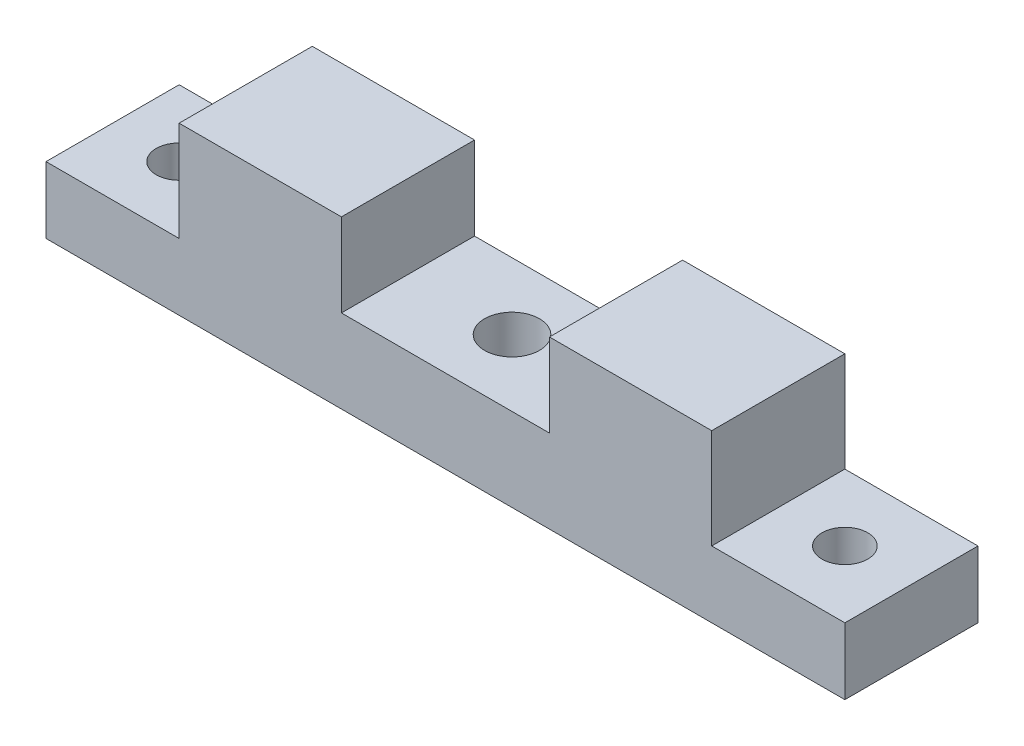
ISO-10303-21;
HEADER;
FILE_DESCRIPTION(('STEP AP214'),'2;1');
FILE_NAME('part.step','',(''),(''),'','','');
FILE_SCHEMA(('AUTOMOTIVE_DESIGN { 1 0 10303 214 1 1 1 1 }'));
ENDSEC;
DATA;
#1=APPLICATION_CONTEXT('core data for automotive mechanical design processes');
#2=APPLICATION_PROTOCOL_DEFINITION('international standard','automotive_design',2000,#1);
#3=PRODUCT_CONTEXT('',#1,'mechanical');
#4=PRODUCT('Part','Part','',(#3));
#5=PRODUCT_RELATED_PRODUCT_CATEGORY('part','',(#4));
#6=PRODUCT_DEFINITION_FORMATION('','',#4);
#7=PRODUCT_DEFINITION_CONTEXT('part definition',#1,'design');
#8=PRODUCT_DEFINITION('design','',#6,#7);
#9=PRODUCT_DEFINITION_SHAPE('','',#8);
#10=(LENGTH_UNIT() NAMED_UNIT(*) SI_UNIT(.MILLI.,.METRE.));
#11=(NAMED_UNIT(*) PLANE_ANGLE_UNIT() SI_UNIT($,.RADIAN.));
#12=(NAMED_UNIT(*) SI_UNIT($,.STERADIAN.) SOLID_ANGLE_UNIT());
#13=UNCERTAINTY_MEASURE_WITH_UNIT(LENGTH_MEASURE(1.E-05),#10,'distance_accuracy_value','');
#14=(GEOMETRIC_REPRESENTATION_CONTEXT(3) GLOBAL_UNCERTAINTY_ASSIGNED_CONTEXT((#13)) GLOBAL_UNIT_ASSIGNED_CONTEXT((#10,
#11,#12)) REPRESENTATION_CONTEXT('',''));
#15=CARTESIAN_POINT('',(0.,0.,0.));
#16=DIRECTION('',(0.,0.,1.));
#17=DIRECTION('',(1.,0.,0.));
#18=AXIS2_PLACEMENT_3D('',#15,#16,#17);
#19=CARTESIAN_POINT('',(-48.,7.99999999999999,8.));
#20=DIRECTION('',(0.,-1.,0.));
#21=DIRECTION('',(0.,0.,-1.));
#22=AXIS2_PLACEMENT_3D('',#19,#20,#21);
#23=PLANE('',#22);
#24=CARTESIAN_POINT('',(-40.,7.99999999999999,0.));
#25=DIRECTION('',(0.,1.,0.));
#26=DIRECTION('',(0.,0.,1.));
#27=AXIS2_PLACEMENT_3D('',#24,#25,#26);
#28=CIRCLE('',#27,2.74999999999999);
#29=CARTESIAN_POINT('',(-40.,7.99999999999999,2.74999999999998));
#30=VERTEX_POINT('',#29);
#31=EDGE_CURVE('E267',#30,#30,#28,.T.);
#32=ORIENTED_EDGE('',*,*,#31,.F.);
#33=EDGE_LOOP('',(#32));
#34=FACE_BOUND('',#33,.T.);
#35=DIRECTION('',(-1.,0.,0.));
#36=VECTOR('',#35,1.);
#37=CARTESIAN_POINT('',(-48.,7.99999999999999,-8.));
#38=LINE('',#37,#36);
#39=CARTESIAN_POINT('',(-32.,7.99999999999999,-8.));
#40=VERTEX_POINT('',#39);
#41=CARTESIAN_POINT('',(-48.,7.99999999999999,-8.));
#42=VERTEX_POINT('',#41);
#43=EDGE_CURVE('E158',#40,#42,#38,.T.);
#44=ORIENTED_EDGE('',*,*,#43,.T.);
#45=DIRECTION('',(0.,0.,-1.));
#46=VECTOR('',#45,1.);
#47=CARTESIAN_POINT('',(-48.,7.99999999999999,8.));
#48=LINE('',#47,#46);
#49=CARTESIAN_POINT('',(-48.,7.99999999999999,8.));
#50=VERTEX_POINT('',#49);
#51=EDGE_CURVE('E11',#50,#42,#48,.T.);
#52=ORIENTED_EDGE('',*,*,#51,.F.);
#53=DIRECTION('',(-1.,0.,0.));
#54=VECTOR('',#53,1.);
#55=CARTESIAN_POINT('',(-48.,7.99999999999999,8.));
#56=LINE('',#55,#54);
#57=CARTESIAN_POINT('',(-32.,7.99999999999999,8.));
#58=VERTEX_POINT('',#57);
#59=EDGE_CURVE('E181',#58,#50,#56,.T.);
#60=ORIENTED_EDGE('',*,*,#59,.F.);
#61=DIRECTION('',(0.,0.,-1.));
#62=VECTOR('',#61,1.);
#63=CARTESIAN_POINT('',(-32.,7.99999999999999,8.));
#64=LINE('',#63,#62);
#65=EDGE_CURVE('E154',#58,#40,#64,.T.);
#66=ORIENTED_EDGE('',*,*,#65,.T.);
#67=EDGE_LOOP('',(#44,#52,#60,#66));
#68=FACE_BOUND('',#67,.T.);
#69=ADVANCED_FACE('F37',(#34,#68),#23,.F.);
#70=CARTESIAN_POINT('',(-48.,7.99999999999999,8.));
#71=DIRECTION('',(1.,0.,0.));
#72=DIRECTION('',(0.,1.,0.));
#73=AXIS2_PLACEMENT_3D('',#70,#71,#72);
#74=PLANE('',#73);
#75=DIRECTION('',(0.,-1.,0.));
#76=VECTOR('',#75,1.);
#77=CARTESIAN_POINT('',(-48.,7.99999999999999,-8.));
#78=LINE('',#77,#76);
#79=CARTESIAN_POINT('',(-48.,0.,-8.));
#80=VERTEX_POINT('',#79);
#81=EDGE_CURVE('E161',#42,#80,#78,.T.);
#82=ORIENTED_EDGE('',*,*,#81,.T.);
#83=DIRECTION('',(0.,0.,-1.));
#84=VECTOR('',#83,1.);
#85=CARTESIAN_POINT('',(-48.,0.,8.));
#86=LINE('',#85,#84);
#87=CARTESIAN_POINT('',(-48.,0.,8.));
#88=VERTEX_POINT('',#87);
#89=EDGE_CURVE('E46',#88,#80,#86,.T.);
#90=ORIENTED_EDGE('',*,*,#89,.F.);
#91=DIRECTION('',(0.,-1.,0.));
#92=VECTOR('',#91,1.);
#93=CARTESIAN_POINT('',(-48.,7.99999999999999,8.));
#94=LINE('',#93,#92);
#95=EDGE_CURVE('E109',#50,#88,#94,.T.);
#96=ORIENTED_EDGE('',*,*,#95,.F.);
#97=ORIENTED_EDGE('',*,*,#51,.T.);
#98=EDGE_LOOP('',(#82,#90,#96,#97));
#99=FACE_BOUND('',#98,.T.);
#100=ADVANCED_FACE('F260',(#99),#74,.F.);
#101=CARTESIAN_POINT('',(-48.,0.,8.));
#102=DIRECTION('',(0.,1.,0.));
#103=DIRECTION('',(0.,0.,1.));
#104=AXIS2_PLACEMENT_3D('',#101,#102,#103);
#105=PLANE('',#104);
#106=CARTESIAN_POINT('',(0.,0.,0.));
#107=DIRECTION('',(0.,-1.,0.));
#108=DIRECTION('',(0.,0.,-1.));
#109=AXIS2_PLACEMENT_3D('',#106,#107,#108);
#110=CIRCLE('',#109,6.9);
#111=CARTESIAN_POINT('',(0.,0.,-6.9));
#112=VERTEX_POINT('',#111);
#113=EDGE_CURVE('E307',#112,#112,#110,.T.);
#114=ORIENTED_EDGE('',*,*,#113,.F.);
#115=EDGE_LOOP('',(#114));
#116=FACE_BOUND('',#115,.T.);
#117=CARTESIAN_POINT('',(-40.,0.,0.));
#118=DIRECTION('',(0.,1.,0.));
#119=DIRECTION('',(0.,0.,1.));
#120=AXIS2_PLACEMENT_3D('',#117,#118,#119);
#121=CIRCLE('',#120,2.74999999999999);
#122=CARTESIAN_POINT('',(-40.,0.,2.74999999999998));
#123=VERTEX_POINT('',#122);
#124=EDGE_CURVE('E269',#123,#123,#121,.T.);
#125=ORIENTED_EDGE('',*,*,#124,.T.);
#126=EDGE_LOOP('',(#125));
#127=FACE_BOUND('',#126,.T.);
#128=CARTESIAN_POINT('',(40.,0.,0.));
#129=DIRECTION('',(0.,1.,0.));
#130=DIRECTION('',(0.,0.,1.));
#131=AXIS2_PLACEMENT_3D('',#128,#129,#130);
#132=CIRCLE('',#131,2.74999999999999);
#133=CARTESIAN_POINT('',(40.,0.,2.74999999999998));
#134=VERTEX_POINT('',#133);
#135=EDGE_CURVE('E162',#134,#134,#132,.T.);
#136=ORIENTED_EDGE('',*,*,#135,.T.);
#137=EDGE_LOOP('',(#136));
#138=FACE_BOUND('',#137,.T.);
#139=DIRECTION('',(1.,0.,0.));
#140=VECTOR('',#139,1.);
#141=CARTESIAN_POINT('',(-48.,0.,-8.));
#142=LINE('',#141,#140);
#143=CARTESIAN_POINT('',(48.,0.,-8.));
#144=VERTEX_POINT('',#143);
#145=EDGE_CURVE('E164',#80,#144,#142,.T.);
#146=ORIENTED_EDGE('',*,*,#145,.T.);
#147=DIRECTION('',(0.,0.,-1.));
#148=VECTOR('',#147,1.);
#149=CARTESIAN_POINT('',(48.,0.,8.));
#150=LINE('',#149,#148);
#151=CARTESIAN_POINT('',(48.,0.,8.));
#152=VERTEX_POINT('',#151);
#153=EDGE_CURVE('E200',#152,#144,#150,.T.);
#154=ORIENTED_EDGE('',*,*,#153,.F.);
#155=DIRECTION('',(1.,0.,0.));
#156=VECTOR('',#155,1.);
#157=CARTESIAN_POINT('',(-48.,0.,8.));
#158=LINE('',#157,#156);
#159=EDGE_CURVE('E209',#88,#152,#158,.T.);
#160=ORIENTED_EDGE('',*,*,#159,.F.);
#161=ORIENTED_EDGE('',*,*,#89,.T.);
#162=EDGE_LOOP('',(#146,#154,#160,#161));
#163=FACE_BOUND('',#162,.T.);
#164=ADVANCED_FACE('F207',(#116,#127,#138,#163),#105,.F.);
#165=CARTESIAN_POINT('',(48.,8.,8.));
#166=DIRECTION('',(-1.,0.,0.));
#167=DIRECTION('',(0.,-1.,0.));
#168=AXIS2_PLACEMENT_3D('',#165,#166,#167);
#169=PLANE('',#168);
#170=DIRECTION('',(0.,1.,0.));
#171=VECTOR('',#170,1.);
#172=CARTESIAN_POINT('',(48.,8.,-8.));
#173=LINE('',#172,#171);
#174=CARTESIAN_POINT('',(48.,8.,-8.));
#175=VERTEX_POINT('',#174);
#176=EDGE_CURVE('E166',#144,#175,#173,.T.);
#177=ORIENTED_EDGE('',*,*,#176,.T.);
#178=DIRECTION('',(0.,0.,-1.));
#179=VECTOR('',#178,1.);
#180=CARTESIAN_POINT('',(48.,8.,8.));
#181=LINE('',#180,#179);
#182=CARTESIAN_POINT('',(48.,8.,8.));
#183=VERTEX_POINT('',#182);
#184=EDGE_CURVE('E197',#183,#175,#181,.T.);
#185=ORIENTED_EDGE('',*,*,#184,.F.);
#186=DIRECTION('',(0.,1.,0.));
#187=VECTOR('',#186,1.);
#188=CARTESIAN_POINT('',(48.,8.,8.));
#189=LINE('',#188,#187);
#190=EDGE_CURVE('E227',#152,#183,#189,.T.);
#191=ORIENTED_EDGE('',*,*,#190,.F.);
#192=ORIENTED_EDGE('',*,*,#153,.T.);
#193=EDGE_LOOP('',(#177,#185,#191,#192));
#194=FACE_BOUND('',#193,.T.);
#195=ADVANCED_FACE('F218',(#194),#169,.F.);
#196=CARTESIAN_POINT('',(48.,8.,8.));
#197=DIRECTION('',(0.,-1.,0.));
#198=DIRECTION('',(1.,0.,0.));
#199=AXIS2_PLACEMENT_3D('',#196,#197,#198);
#200=PLANE('',#199);
#201=CARTESIAN_POINT('',(40.,7.99999999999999,0.));
#202=DIRECTION('',(0.,1.,0.));
#203=DIRECTION('',(0.,0.,1.));
#204=AXIS2_PLACEMENT_3D('',#201,#202,#203);
#205=CIRCLE('',#204,2.74999999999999);
#206=CARTESIAN_POINT('',(40.,7.99999999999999,2.74999999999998));
#207=VERTEX_POINT('',#206);
#208=EDGE_CURVE('E272',#207,#207,#205,.T.);
#209=ORIENTED_EDGE('',*,*,#208,.F.);
#210=EDGE_LOOP('',(#209));
#211=FACE_BOUND('',#210,.T.);
#212=DIRECTION('',(-1.,0.,0.));
#213=VECTOR('',#212,1.);
#214=CARTESIAN_POINT('',(48.,8.,-8.));
#215=LINE('',#214,#213);
#216=CARTESIAN_POINT('',(32.,7.99999999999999,-8.));
#217=VERTEX_POINT('',#216);
#218=EDGE_CURVE('E168',#175,#217,#215,.T.);
#219=ORIENTED_EDGE('',*,*,#218,.T.);
#220=DIRECTION('',(0.,0.,-1.));
#221=VECTOR('',#220,1.);
#222=CARTESIAN_POINT('',(32.,7.99999999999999,8.));
#223=LINE('',#222,#221);
#224=CARTESIAN_POINT('',(32.,7.99999999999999,8.));
#225=VERTEX_POINT('',#224);
#226=EDGE_CURVE('E194',#225,#217,#223,.T.);
#227=ORIENTED_EDGE('',*,*,#226,.F.);
#228=DIRECTION('',(-1.,0.,0.));
#229=VECTOR('',#228,1.);
#230=CARTESIAN_POINT('',(48.,8.,8.));
#231=LINE('',#230,#229);
#232=EDGE_CURVE('E224',#183,#225,#231,.T.);
#233=ORIENTED_EDGE('',*,*,#232,.F.);
#234=ORIENTED_EDGE('',*,*,#184,.T.);
#235=EDGE_LOOP('',(#219,#227,#233,#234));
#236=FACE_BOUND('',#235,.T.);
#237=ADVANCED_FACE('F222',(#211,#236),#200,.F.);
#238=CARTESIAN_POINT('',(32.,7.99999999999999,8.));
#239=DIRECTION('',(-1.,0.,0.));
#240=DIRECTION('',(0.,0.,1.));
#241=AXIS2_PLACEMENT_3D('',#238,#239,#240);
#242=PLANE('',#241);
#243=DIRECTION('',(0.,1.,0.));
#244=VECTOR('',#243,1.);
#245=CARTESIAN_POINT('',(32.,7.99999999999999,-8.));
#246=LINE('',#245,#244);
#247=CARTESIAN_POINT('',(32.,20.,-8.));
#248=VERTEX_POINT('',#247);
#249=EDGE_CURVE('E170',#217,#248,#246,.T.);
#250=ORIENTED_EDGE('',*,*,#249,.T.);
#251=DIRECTION('',(0.,0.,-1.));
#252=VECTOR('',#251,1.);
#253=CARTESIAN_POINT('',(32.,20.,8.));
#254=LINE('',#253,#252);
#255=CARTESIAN_POINT('',(32.,20.,8.));
#256=VERTEX_POINT('',#255);
#257=EDGE_CURVE('E191',#256,#248,#254,.T.);
#258=ORIENTED_EDGE('',*,*,#257,.F.);
#259=DIRECTION('',(0.,1.,0.));
#260=VECTOR('',#259,1.);
#261=CARTESIAN_POINT('',(32.,7.99999999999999,8.));
#262=LINE('',#261,#260);
#263=EDGE_CURVE('E226',#225,#256,#262,.T.);
#264=ORIENTED_EDGE('',*,*,#263,.F.);
#265=ORIENTED_EDGE('',*,*,#226,.T.);
#266=EDGE_LOOP('',(#250,#258,#264,#265));
#267=FACE_BOUND('',#266,.T.);
#268=ADVANCED_FACE('F288',(#267),#242,.F.);
#269=CARTESIAN_POINT('',(12.5,20.,8.));
#270=DIRECTION('',(0.,-1.,0.));
#271=DIRECTION('',(0.,0.,-1.));
#272=AXIS2_PLACEMENT_3D('',#269,#270,#271);
#273=PLANE('',#272);
#274=DIRECTION('',(-1.,0.,0.));
#275=VECTOR('',#274,1.);
#276=CARTESIAN_POINT('',(12.5,20.,-8.));
#277=LINE('',#276,#275);
#278=CARTESIAN_POINT('',(12.5,20.,-8.));
#279=VERTEX_POINT('',#278);
#280=EDGE_CURVE('E172',#248,#279,#277,.T.);
#281=ORIENTED_EDGE('',*,*,#280,.T.);
#282=DIRECTION('',(0.,0.,-1.));
#283=VECTOR('',#282,1.);
#284=CARTESIAN_POINT('',(12.5,20.,8.));
#285=LINE('',#284,#283);
#286=CARTESIAN_POINT('',(12.5,20.,8.));
#287=VERTEX_POINT('',#286);
#288=EDGE_CURVE('E188',#287,#279,#285,.T.);
#289=ORIENTED_EDGE('',*,*,#288,.F.);
#290=DIRECTION('',(-1.,0.,0.));
#291=VECTOR('',#290,1.);
#292=CARTESIAN_POINT('',(12.5,20.,8.));
#293=LINE('',#292,#291);
#294=EDGE_CURVE('E229',#256,#287,#293,.T.);
#295=ORIENTED_EDGE('',*,*,#294,.F.);
#296=ORIENTED_EDGE('',*,*,#257,.T.);
#297=EDGE_LOOP('',(#281,#289,#295,#296));
#298=FACE_BOUND('',#297,.T.);
#299=ADVANCED_FACE('F294',(#298),#273,.F.);
#300=CARTESIAN_POINT('',(12.5,10.,8.));
#301=DIRECTION('',(1.,0.,0.));
#302=DIRECTION('',(0.,1.,0.));
#303=AXIS2_PLACEMENT_3D('',#300,#301,#302);
#304=PLANE('',#303);
#305=DIRECTION('',(0.,-1.,0.));
#306=VECTOR('',#305,1.);
#307=CARTESIAN_POINT('',(12.5,10.,-8.));
#308=LINE('',#307,#306);
#309=CARTESIAN_POINT('',(12.5,10.,-8.));
#310=VERTEX_POINT('',#309);
#311=EDGE_CURVE('E174',#279,#310,#308,.T.);
#312=ORIENTED_EDGE('',*,*,#311,.T.);
#313=DIRECTION('',(0.,0.,-1.));
#314=VECTOR('',#313,1.);
#315=CARTESIAN_POINT('',(12.5,10.,8.));
#316=LINE('',#315,#314);
#317=CARTESIAN_POINT('',(12.5,10.,8.));
#318=VERTEX_POINT('',#317);
#319=EDGE_CURVE('E185',#318,#310,#316,.T.);
#320=ORIENTED_EDGE('',*,*,#319,.F.);
#321=DIRECTION('',(0.,-1.,0.));
#322=VECTOR('',#321,1.);
#323=CARTESIAN_POINT('',(12.5,10.,8.));
#324=LINE('',#323,#322);
#325=EDGE_CURVE('E235',#287,#318,#324,.T.);
#326=ORIENTED_EDGE('',*,*,#325,.F.);
#327=ORIENTED_EDGE('',*,*,#288,.T.);
#328=EDGE_LOOP('',(#312,#320,#326,#327));
#329=FACE_BOUND('',#328,.T.);
#330=ADVANCED_FACE('F241',(#329),#304,.F.);
#331=CARTESIAN_POINT('',(-12.5,10.,8.));
#332=DIRECTION('',(0.,-1.,0.));
#333=DIRECTION('',(0.,0.,-1.));
#334=AXIS2_PLACEMENT_3D('',#331,#332,#333);
#335=PLANE('',#334);
#336=CARTESIAN_POINT('',(0.,10.,0.));
#337=DIRECTION('',(0.,-1.,0.));
#338=DIRECTION('',(0.,0.,-1.));
#339=AXIS2_PLACEMENT_3D('',#336,#337,#338);
#340=CIRCLE('',#339,3.3);
#341=CARTESIAN_POINT('',(0.,10.,-3.3));
#342=VERTEX_POINT('',#341);
#343=EDGE_CURVE('E40',#342,#342,#340,.T.);
#344=ORIENTED_EDGE('',*,*,#343,.T.);
#345=EDGE_LOOP('',(#344));
#346=FACE_BOUND('',#345,.T.);
#347=DIRECTION('',(-1.,0.,0.));
#348=VECTOR('',#347,1.);
#349=CARTESIAN_POINT('',(-12.5,10.,-8.));
#350=LINE('',#349,#348);
#351=CARTESIAN_POINT('',(-12.5,10.,-8.));
#352=VERTEX_POINT('',#351);
#353=EDGE_CURVE('E176',#310,#352,#350,.T.);
#354=ORIENTED_EDGE('',*,*,#353,.T.);
#355=DIRECTION('',(0.,0.,-1.));
#356=VECTOR('',#355,1.);
#357=CARTESIAN_POINT('',(-12.5,10.,8.));
#358=LINE('',#357,#356);
#359=CARTESIAN_POINT('',(-12.5,10.,8.));
#360=VERTEX_POINT('',#359);
#361=EDGE_CURVE('E149',#360,#352,#358,.T.);
#362=ORIENTED_EDGE('',*,*,#361,.F.);
#363=DIRECTION('',(-1.,0.,0.));
#364=VECTOR('',#363,1.);
#365=CARTESIAN_POINT('',(-12.5,10.,8.));
#366=LINE('',#365,#364);
#367=EDGE_CURVE('E140',#318,#360,#366,.T.);
#368=ORIENTED_EDGE('',*,*,#367,.F.);
#369=ORIENTED_EDGE('',*,*,#319,.T.);
#370=EDGE_LOOP('',(#354,#362,#368,#369));
#371=FACE_BOUND('',#370,.T.);
#372=ADVANCED_FACE('F245',(#346,#371),#335,.F.);
#373=CARTESIAN_POINT('',(-12.5,20.,8.));
#374=DIRECTION('',(-1.,0.,0.));
#375=DIRECTION('',(0.,-1.,0.));
#376=AXIS2_PLACEMENT_3D('',#373,#374,#375);
#377=PLANE('',#376);
#378=DIRECTION('',(0.,1.,0.));
#379=VECTOR('',#378,1.);
#380=CARTESIAN_POINT('',(-12.5,20.,-8.));
#381=LINE('',#380,#379);
#382=CARTESIAN_POINT('',(-12.5,20.,-8.));
#383=VERTEX_POINT('',#382);
#384=EDGE_CURVE('E148',#352,#383,#381,.T.);
#385=ORIENTED_EDGE('',*,*,#384,.T.);
#386=DIRECTION('',(0.,0.,-1.));
#387=VECTOR('',#386,1.);
#388=CARTESIAN_POINT('',(-12.5,20.,8.));
#389=LINE('',#388,#387);
#390=CARTESIAN_POINT('',(-12.5,20.,8.));
#391=VERTEX_POINT('',#390);
#392=EDGE_CURVE('E145',#391,#383,#389,.T.);
#393=ORIENTED_EDGE('',*,*,#392,.F.);
#394=DIRECTION('',(0.,1.,0.));
#395=VECTOR('',#394,1.);
#396=CARTESIAN_POINT('',(-12.5,20.,8.));
#397=LINE('',#396,#395);
#398=EDGE_CURVE('E134',#360,#391,#397,.T.);
#399=ORIENTED_EDGE('',*,*,#398,.F.);
#400=ORIENTED_EDGE('',*,*,#361,.T.);
#401=EDGE_LOOP('',(#385,#393,#399,#400));
#402=FACE_BOUND('',#401,.T.);
#403=ADVANCED_FACE('F146',(#402),#377,.F.);
#404=CARTESIAN_POINT('',(-12.5,20.,8.));
#405=DIRECTION('',(0.,-1.,0.));
#406=DIRECTION('',(0.,0.,-1.));
#407=AXIS2_PLACEMENT_3D('',#404,#405,#406);
#408=PLANE('',#407);
#409=DIRECTION('',(-1.,0.,0.));
#410=VECTOR('',#409,1.);
#411=CARTESIAN_POINT('',(-12.5,20.,-8.));
#412=LINE('',#411,#410);
#413=CARTESIAN_POINT('',(-32.,20.,-8.));
#414=VERTEX_POINT('',#413);
#415=EDGE_CURVE('E95',#383,#414,#412,.T.);
#416=ORIENTED_EDGE('',*,*,#415,.T.);
#417=DIRECTION('',(0.,0.,-1.));
#418=VECTOR('',#417,1.);
#419=CARTESIAN_POINT('',(-32.,20.,8.));
#420=LINE('',#419,#418);
#421=CARTESIAN_POINT('',(-32.,20.,8.));
#422=VERTEX_POINT('',#421);
#423=EDGE_CURVE('E150',#422,#414,#420,.T.);
#424=ORIENTED_EDGE('',*,*,#423,.F.);
#425=DIRECTION('',(-1.,0.,0.));
#426=VECTOR('',#425,1.);
#427=CARTESIAN_POINT('',(-12.5,20.,8.));
#428=LINE('',#427,#426);
#429=EDGE_CURVE('E138',#391,#422,#428,.T.);
#430=ORIENTED_EDGE('',*,*,#429,.F.);
#431=ORIENTED_EDGE('',*,*,#392,.T.);
#432=EDGE_LOOP('',(#416,#424,#430,#431));
#433=FACE_BOUND('',#432,.T.);
#434=ADVANCED_FACE('F152',(#433),#408,.F.);
#435=CARTESIAN_POINT('',(-32.,7.99999999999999,8.));
#436=DIRECTION('',(1.,0.,0.));
#437=DIRECTION('',(0.,0.,-1.));
#438=AXIS2_PLACEMENT_3D('',#435,#436,#437);
#439=PLANE('',#438);
#440=DIRECTION('',(0.,-1.,0.));
#441=VECTOR('',#440,1.);
#442=CARTESIAN_POINT('',(-32.,7.99999999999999,-8.));
#443=LINE('',#442,#441);
#444=EDGE_CURVE('E101',#414,#40,#443,.T.);
#445=ORIENTED_EDGE('',*,*,#444,.T.);
#446=ORIENTED_EDGE('',*,*,#65,.F.);
#447=DIRECTION('',(0.,-1.,0.));
#448=VECTOR('',#447,1.);
#449=CARTESIAN_POINT('',(-32.,7.99999999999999,8.));
#450=LINE('',#449,#448);
#451=EDGE_CURVE('E54',#422,#58,#450,.T.);
#452=ORIENTED_EDGE('',*,*,#451,.F.);
#453=ORIENTED_EDGE('',*,*,#423,.T.);
#454=EDGE_LOOP('',(#445,#446,#452,#453));
#455=FACE_BOUND('',#454,.T.);
#456=ADVANCED_FACE('F249',(#455),#439,.F.);
#457=CARTESIAN_POINT('',(-32.,7.99999999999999,8.));
#458=DIRECTION('',(0.,0.,1.));
#459=DIRECTION('',(1.,0.,0.));
#460=AXIS2_PLACEMENT_3D('',#457,#458,#459);
#461=PLANE('',#460);
#462=ORIENTED_EDGE('',*,*,#59,.T.);
#463=ORIENTED_EDGE('',*,*,#95,.T.);
#464=ORIENTED_EDGE('',*,*,#159,.T.);
#465=ORIENTED_EDGE('',*,*,#190,.T.);
#466=ORIENTED_EDGE('',*,*,#232,.T.);
#467=ORIENTED_EDGE('',*,*,#263,.T.);
#468=ORIENTED_EDGE('',*,*,#294,.T.);
#469=ORIENTED_EDGE('',*,*,#325,.T.);
#470=ORIENTED_EDGE('',*,*,#367,.T.);
#471=ORIENTED_EDGE('',*,*,#398,.T.);
#472=ORIENTED_EDGE('',*,*,#429,.T.);
#473=ORIENTED_EDGE('',*,*,#451,.T.);
#474=EDGE_LOOP('',(#462,#463,#464,#465,#466,#467,#468,#469,#470,#471,#472,#473));
#475=FACE_BOUND('',#474,.T.);
#476=ADVANCED_FACE('F136',(#475),#461,.T.);
#477=CARTESIAN_POINT('',(-32.,7.99999999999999,-8.));
#478=DIRECTION('',(0.,0.,1.));
#479=DIRECTION('',(1.,0.,0.));
#480=AXIS2_PLACEMENT_3D('',#477,#478,#479);
#481=PLANE('',#480);
#482=ORIENTED_EDGE('',*,*,#43,.F.);
#483=ORIENTED_EDGE('',*,*,#444,.F.);
#484=ORIENTED_EDGE('',*,*,#415,.F.);
#485=ORIENTED_EDGE('',*,*,#384,.F.);
#486=ORIENTED_EDGE('',*,*,#353,.F.);
#487=ORIENTED_EDGE('',*,*,#311,.F.);
#488=ORIENTED_EDGE('',*,*,#280,.F.);
#489=ORIENTED_EDGE('',*,*,#249,.F.);
#490=ORIENTED_EDGE('',*,*,#218,.F.);
#491=ORIENTED_EDGE('',*,*,#176,.F.);
#492=ORIENTED_EDGE('',*,*,#145,.F.);
#493=ORIENTED_EDGE('',*,*,#81,.F.);
#494=EDGE_LOOP('',(#482,#483,#484,#485,#486,#487,#488,#489,#490,#491,#492,#493));
#495=FACE_BOUND('',#494,.T.);
#496=ADVANCED_FACE('F213',(#495),#481,.F.);
#497=CARTESIAN_POINT('',(40.,0.,0.));
#498=DIRECTION('',(0.,1.,0.));
#499=DIRECTION('',(0.,0.,1.));
#500=AXIS2_PLACEMENT_3D('',#497,#498,#499);
#501=CYLINDRICAL_SURFACE('',#500,2.74999999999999);
#502=ORIENTED_EDGE('',*,*,#135,.F.);
#503=EDGE_LOOP('',(#502));
#504=FACE_BOUND('',#503,.T.);
#505=ORIENTED_EDGE('',*,*,#208,.T.);
#506=EDGE_LOOP('',(#505));
#507=FACE_BOUND('',#506,.T.);
#508=ADVANCED_FACE('F285',(#504,#507),#501,.F.);
#509=CARTESIAN_POINT('',(-40.,0.,0.));
#510=DIRECTION('',(0.,1.,0.));
#511=DIRECTION('',(0.,0.,1.));
#512=AXIS2_PLACEMENT_3D('',#509,#510,#511);
#513=CYLINDRICAL_SURFACE('',#512,2.74999999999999);
#514=ORIENTED_EDGE('',*,*,#124,.F.);
#515=EDGE_LOOP('',(#514));
#516=FACE_BOUND('',#515,.T.);
#517=ORIENTED_EDGE('',*,*,#31,.T.);
#518=EDGE_LOOP('',(#517));
#519=FACE_BOUND('',#518,.T.);
#520=ADVANCED_FACE('F313',(#516,#519),#513,.F.);
#521=CARTESIAN_POINT('',(0.,0.,0.));
#522=DIRECTION('',(0.,-1.,0.));
#523=DIRECTION('',(0.,0.,-1.));
#524=AXIS2_PLACEMENT_3D('',#521,#522,#523);
#525=CYLINDRICAL_SURFACE('',#524,3.3);
#526=CARTESIAN_POINT('',(0.,3.59999999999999,0.));
#527=DIRECTION('',(0.,-1.,0.));
#528=DIRECTION('',(0.,0.,-1.));
#529=AXIS2_PLACEMENT_3D('',#526,#527,#528);
#530=CIRCLE('',#529,3.3);
#531=CARTESIAN_POINT('',(0.,3.59999999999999,-3.3));
#532=VERTEX_POINT('',#531);
#533=EDGE_CURVE('E275',#532,#532,#530,.T.);
#534=ORIENTED_EDGE('',*,*,#533,.T.);
#535=EDGE_LOOP('',(#534));
#536=FACE_BOUND('',#535,.T.);
#537=ORIENTED_EDGE('',*,*,#343,.F.);
#538=EDGE_LOOP('',(#537));
#539=FACE_BOUND('',#538,.T.);
#540=ADVANCED_FACE('F319',(#536,#539),#525,.F.);
#541=CARTESIAN_POINT('',(0.,0.,0.));
#542=DIRECTION('',(0.,-1.,0.));
#543=DIRECTION('',(0.,0.,-1.));
#544=AXIS2_PLACEMENT_3D('',#541,#542,#543);
#545=CONICAL_SURFACE('',#544,6.9,0.785398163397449);
#546=ORIENTED_EDGE('',*,*,#533,.F.);
#547=EDGE_LOOP('',(#546));
#548=FACE_BOUND('',#547,.T.);
#549=ORIENTED_EDGE('',*,*,#113,.T.);
#550=EDGE_LOOP('',(#549));
#551=FACE_BOUND('',#550,.T.);
#552=ADVANCED_FACE('F325',(#548,#551),#545,.F.);
#553=CLOSED_SHELL('',(#69,#100,#164,#195,#237,#268,#299,#330,#372,#403,#434,#456,#476,#496,#508,
#520,#540,#552));
#554=MANIFOLD_SOLID_BREP('B2',#553);
#555=ADVANCED_BREP_SHAPE_REPRESENTATION('',(#18,#554),#14);
#556=SHAPE_DEFINITION_REPRESENTATION(#9,#555);
ENDSEC;
END-ISO-10303-21;
